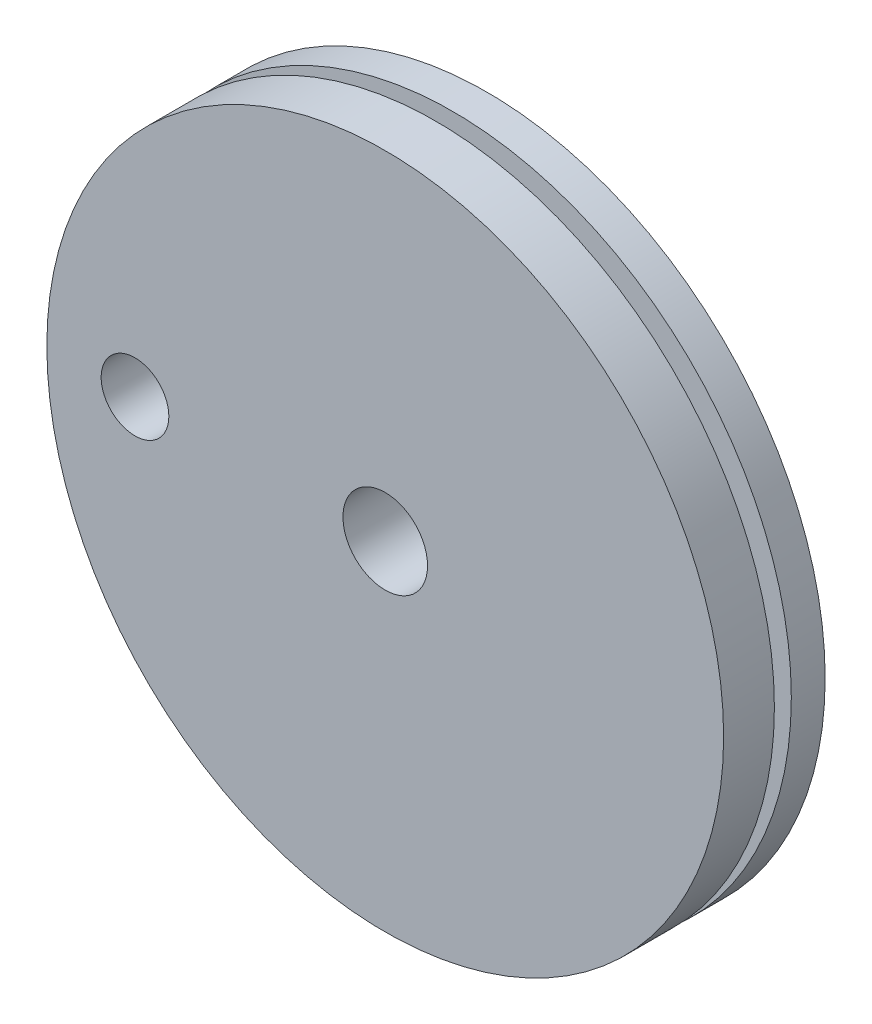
from build123d import *

# Parameters (mm, degrees)
ESQUISSE1_R             = 20
EXTRUSION2_DEPTH        = 3
ESQUISSE2_OUTSIDE_W     = 53.33
ESQUISSE2_OUTSIDE_H     = 53.33
ESQUISSE2_OUTSIDE_R     = 18.5
ENL_V_MAT_EXTRU_1_DEPTH = 1
ESQUISSE3_R             = 20
EXTRUSION3_DEPTH        = 3
ESQUISSE4_R             = 2.5
ESQUISSE4_R_2           = 2
ENL_V_MAT_EXTRU_2_DEPTH = 29.91366459


with BuildPart() as part:
    # Esquisse1 → Extrusion2 (new body)
    with BuildSketch(Plane.XY):
        Circle(ESQUISSE1_R)
    extrude(amount=EXTRUSION2_DEPTH)

    # Esquisse2 outside → Enl_v. mat.-Extru.1 (cut)
    with BuildSketch(Plane.XY.offset(3)):
        Rectangle(ESQUISSE2_OUTSIDE_W, ESQUISSE2_OUTSIDE_H)
        Circle(ESQUISSE2_OUTSIDE_R, mode=Mode.SUBTRACT)
    extrude(amount=-ENL_V_MAT_EXTRU_1_DEPTH, mode=Mode.SUBTRACT)

    # Esquisse3 → Extrusion3 (add)
    with BuildSketch(Plane.XY.offset(3)):
        Circle(ESQUISSE3_R)
    extrude(amount=EXTRUSION3_DEPTH)

    # Esquisse4 → Enl_v. mat.-Extru.2 (cut, through all)
    with BuildSketch(Plane.XY.offset(6)):
        Circle(ESQUISSE4_R)
        with Locations((-14.788798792, 0)):
            Circle(ESQUISSE4_R_2)
    extrude(amount=-ENL_V_MAT_EXTRU_2_DEPTH, mode=Mode.SUBTRACT)


solid = part.part
